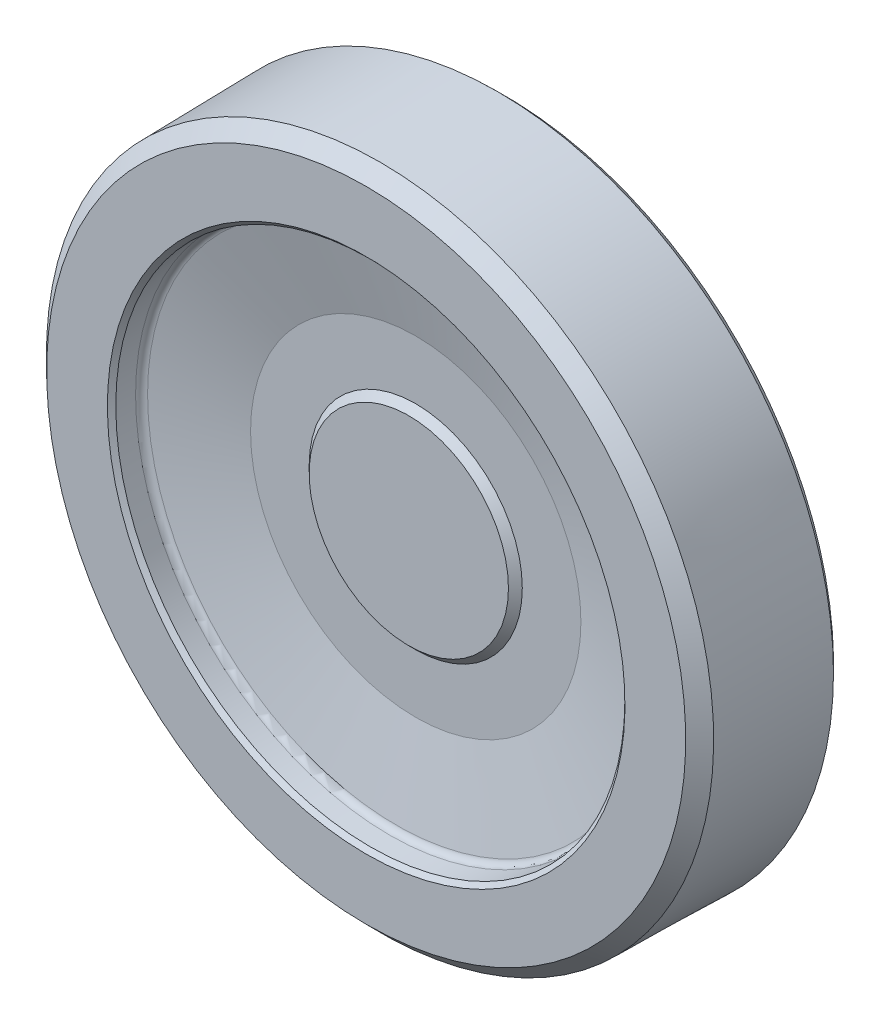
ISO-10303-21;
HEADER;
FILE_DESCRIPTION(('STEP AP214'),'2;1');
FILE_NAME('part.step','',(''),(''),'','','');
FILE_SCHEMA(('AUTOMOTIVE_DESIGN { 1 0 10303 214 1 1 1 1 }'));
ENDSEC;
DATA;
#1=APPLICATION_CONTEXT('core data for automotive mechanical design processes');
#2=APPLICATION_PROTOCOL_DEFINITION('international standard','automotive_design',2000,#1);
#3=PRODUCT_CONTEXT('',#1,'mechanical');
#4=PRODUCT('Part','Part','',(#3));
#5=PRODUCT_RELATED_PRODUCT_CATEGORY('part','',(#4));
#6=PRODUCT_DEFINITION_FORMATION('','',#4);
#7=PRODUCT_DEFINITION_CONTEXT('part definition',#1,'design');
#8=PRODUCT_DEFINITION('design','',#6,#7);
#9=PRODUCT_DEFINITION_SHAPE('','',#8);
#10=(LENGTH_UNIT() NAMED_UNIT(*) SI_UNIT(.MILLI.,.METRE.));
#11=(NAMED_UNIT(*) PLANE_ANGLE_UNIT() SI_UNIT($,.RADIAN.));
#12=(NAMED_UNIT(*) SI_UNIT($,.STERADIAN.) SOLID_ANGLE_UNIT());
#13=UNCERTAINTY_MEASURE_WITH_UNIT(LENGTH_MEASURE(1.E-05),#10,'distance_accuracy_value','');
#14=(GEOMETRIC_REPRESENTATION_CONTEXT(3) GLOBAL_UNCERTAINTY_ASSIGNED_CONTEXT((#13)) GLOBAL_UNIT_ASSIGNED_CONTEXT((#10,
#11,#12)) REPRESENTATION_CONTEXT('',''));
#15=CARTESIAN_POINT('',(0.,0.,0.));
#16=DIRECTION('',(0.,0.,1.));
#17=DIRECTION('',(1.,0.,0.));
#18=AXIS2_PLACEMENT_3D('',#15,#16,#17);
#19=CARTESIAN_POINT('',(9.5,0.,0.));
#20=DIRECTION('',(0.,0.,1.));
#21=DIRECTION('',(0.,-1.,0.));
#22=AXIS2_PLACEMENT_3D('',#19,#20,#21);
#23=PLANE('',#22);
#24=CARTESIAN_POINT('',(0.,0.,0.));
#25=DIRECTION('',(0.,0.,1.));
#26=DIRECTION('',(-1.,0.,0.));
#27=AXIS2_PLACEMENT_3D('',#24,#25,#26);
#28=CIRCLE('',#27,9.5);
#29=CARTESIAN_POINT('',(-9.5,0.,0.));
#30=VERTEX_POINT('',#29);
#31=EDGE_CURVE('E15',#30,#30,#28,.T.);
#32=ORIENTED_EDGE('',*,*,#31,.F.);
#33=EDGE_LOOP('',(#32));
#34=FACE_BOUND('',#33,.T.);
#35=ADVANCED_FACE('F12',(#34),#23,.F.);
#36=CARTESIAN_POINT('',(0.,0.,0.5));
#37=DIRECTION('',(0.,0.,1.));
#38=DIRECTION('',(-1.,0.,0.));
#39=AXIS2_PLACEMENT_3D('',#36,#37,#38);
#40=CONICAL_SURFACE('',#39,10.,0.785398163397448);
#41=CARTESIAN_POINT('',(0.,0.,0.5));
#42=DIRECTION('',(0.,0.,1.));
#43=DIRECTION('',(0.,-1.,0.));
#44=AXIS2_PLACEMENT_3D('',#41,#42,#43);
#45=CIRCLE('',#44,10.);
#46=CARTESIAN_POINT('',(0.,-10.,0.5));
#47=VERTEX_POINT('',#46);
#48=EDGE_CURVE('E186',#47,#47,#45,.T.);
#49=ORIENTED_EDGE('',*,*,#48,.F.);
#50=EDGE_LOOP('',(#49));
#51=FACE_BOUND('',#50,.T.);
#52=ORIENTED_EDGE('',*,*,#31,.T.);
#53=EDGE_LOOP('',(#52));
#54=FACE_BOUND('',#53,.T.);
#55=ADVANCED_FACE('F112',(#51,#54),#40,.T.);
#56=CARTESIAN_POINT('',(0.,0.,0.));
#57=DIRECTION('',(0.,0.,1.));
#58=DIRECTION('',(0.,-1.,0.));
#59=AXIS2_PLACEMENT_3D('',#56,#57,#58);
#60=CYLINDRICAL_SURFACE('',#59,10.);
#61=CARTESIAN_POINT('',(0.,0.,10.));
#62=DIRECTION('',(0.,0.,1.));
#63=DIRECTION('',(0.,-1.,0.));
#64=AXIS2_PLACEMENT_3D('',#61,#62,#63);
#65=CIRCLE('',#64,10.);
#66=CARTESIAN_POINT('',(0.,-10.,10.));
#67=VERTEX_POINT('',#66);
#68=EDGE_CURVE('E184',#67,#67,#65,.F.);
#69=ORIENTED_EDGE('',*,*,#68,.T.);
#70=EDGE_LOOP('',(#69));
#71=FACE_BOUND('',#70,.T.);
#72=ORIENTED_EDGE('',*,*,#48,.T.);
#73=EDGE_LOOP('',(#72));
#74=FACE_BOUND('',#73,.T.);
#75=ADVANCED_FACE('F109',(#71,#74),#60,.T.);
#76=CARTESIAN_POINT('',(0.,0.,24.));
#77=DIRECTION('',(0.,0.,-1.));
#78=DIRECTION('',(0.,1.,0.));
#79=AXIS2_PLACEMENT_3D('',#76,#77,#78);
#80=PLANE('',#79);
#81=CARTESIAN_POINT('',(0.,0.,24.));
#82=DIRECTION('',(0.,0.,-1.));
#83=DIRECTION('',(1.,0.,0.));
#84=AXIS2_PLACEMENT_3D('',#81,#82,#83);
#85=CIRCLE('',#84,9.35);
#86=CARTESIAN_POINT('',(9.35,0.,24.));
#87=VERTEX_POINT('',#86);
#88=EDGE_CURVE('E179',#87,#87,#85,.T.);
#89=ORIENTED_EDGE('',*,*,#88,.F.);
#90=EDGE_LOOP('',(#89));
#91=FACE_BOUND('',#90,.T.);
#92=ADVANCED_FACE('F105',(#91),#80,.F.);
#93=CARTESIAN_POINT('',(14.,0.,10.));
#94=DIRECTION('',(0.,0.,1.));
#95=DIRECTION('',(0.,-1.,0.));
#96=AXIS2_PLACEMENT_3D('',#93,#94,#95);
#97=PLANE('',#96);
#98=CARTESIAN_POINT('',(0.,0.,10.));
#99=DIRECTION('',(0.,0.,1.));
#100=DIRECTION('',(0.,-1.,0.));
#101=AXIS2_PLACEMENT_3D('',#98,#99,#100);
#102=CIRCLE('',#101,14.);
#103=CARTESIAN_POINT('',(0.,-14.,10.));
#104=VERTEX_POINT('',#103);
#105=EDGE_CURVE('E174',#104,#104,#102,.T.);
#106=ORIENTED_EDGE('',*,*,#105,.F.);
#107=EDGE_LOOP('',(#106));
#108=FACE_BOUND('',#107,.T.);
#109=ORIENTED_EDGE('',*,*,#68,.F.);
#110=EDGE_LOOP('',(#109));
#111=FACE_BOUND('',#110,.T.);
#112=ADVANCED_FACE('F101',(#108,#111),#97,.F.);
#113=CARTESIAN_POINT('',(0.,0.,23.35));
#114=DIRECTION('',(0.,0.,-1.));
#115=DIRECTION('',(1.,0.,0.));
#116=AXIS2_PLACEMENT_3D('',#113,#114,#115);
#117=CONICAL_SURFACE('',#116,10.,0.785398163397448);
#118=ORIENTED_EDGE('',*,*,#88,.T.);
#119=EDGE_LOOP('',(#118));
#120=FACE_BOUND('',#119,.T.);
#121=CARTESIAN_POINT('',(0.,0.,23.35));
#122=DIRECTION('',(0.,0.,-1.));
#123=DIRECTION('',(1.,0.,0.));
#124=AXIS2_PLACEMENT_3D('',#121,#122,#123);
#125=CIRCLE('',#124,10.);
#126=CARTESIAN_POINT('',(10.,0.,23.35));
#127=VERTEX_POINT('',#126);
#128=EDGE_CURVE('E170',#127,#127,#125,.F.);
#129=ORIENTED_EDGE('',*,*,#128,.T.);
#130=EDGE_LOOP('',(#129));
#131=FACE_BOUND('',#130,.T.);
#132=ADVANCED_FACE('F97',(#120,#131),#117,.T.);
#133=CARTESIAN_POINT('',(0.,0.,0.));
#134=DIRECTION('',(0.,0.,1.));
#135=DIRECTION('',(0.,-1.,0.));
#136=AXIS2_PLACEMENT_3D('',#133,#134,#135);
#137=CYLINDRICAL_SURFACE('',#136,14.);
#138=CARTESIAN_POINT('',(0.,0.,12.0560232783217));
#139=DIRECTION('',(0.,0.,-1.));
#140=DIRECTION('',(0.,1.,0.));
#141=AXIS2_PLACEMENT_3D('',#138,#139,#140);
#142=CIRCLE('',#141,14.);
#143=CARTESIAN_POINT('',(0.,14.,12.0560232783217));
#144=VERTEX_POINT('',#143);
#145=EDGE_CURVE('E82',#144,#144,#142,.T.);
#146=ORIENTED_EDGE('',*,*,#145,.T.);
#147=EDGE_LOOP('',(#146));
#148=FACE_BOUND('',#147,.T.);
#149=ORIENTED_EDGE('',*,*,#105,.T.);
#150=EDGE_LOOP('',(#149));
#151=FACE_BOUND('',#150,.T.);
#152=ADVANCED_FACE('F93',(#148,#151),#137,.T.);
#153=CARTESIAN_POINT('',(10.,0.,23.35));
#154=DIRECTION('',(0.,0.,-1.));
#155=DIRECTION('',(0.,1.,0.));
#156=AXIS2_PLACEMENT_3D('',#153,#154,#155);
#157=PLANE('',#156);
#158=ORIENTED_EDGE('',*,*,#128,.F.);
#159=EDGE_LOOP('',(#158));
#160=FACE_BOUND('',#159,.T.);
#161=CARTESIAN_POINT('',(0.,0.,23.35));
#162=DIRECTION('',(0.,0.,1.));
#163=DIRECTION('',(-1.,0.,0.));
#164=AXIS2_PLACEMENT_3D('',#161,#162,#163);
#165=CIRCLE('',#164,15.5);
#166=CARTESIAN_POINT('',(-15.5,0.,23.35));
#167=VERTEX_POINT('',#166);
#168=EDGE_CURVE('E77',#167,#167,#165,.T.);
#169=ORIENTED_EDGE('',*,*,#168,.T.);
#170=EDGE_LOOP('',(#169));
#171=FACE_BOUND('',#170,.T.);
#172=ADVANCED_FACE('F89',(#160,#171),#157,.F.);
#173=CARTESIAN_POINT('',(0.,0.,12.0560232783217));
#174=DIRECTION('',(0.,0.,-1.));
#175=DIRECTION('',(0.,1.,0.));
#176=AXIS2_PLACEMENT_3D('',#173,#174,#175);
#177=TOROIDAL_SURFACE('',#176,15.3,1.3);
#178=CARTESIAN_POINT('',(0.,0.,13.2776236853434));
#179=DIRECTION('',(0.,0.,1.));
#180=DIRECTION('',(0.,-1.,0.));
#181=AXIS2_PLACEMENT_3D('',#178,#179,#180);
#182=CIRCLE('',#181,14.8553738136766);
#183=CARTESIAN_POINT('',(0.,-14.8553738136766,13.2776236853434));
#184=VERTEX_POINT('',#183);
#185=EDGE_CURVE('E72',#184,#184,#182,.T.);
#186=ORIENTED_EDGE('',*,*,#185,.F.);
#187=EDGE_LOOP('',(#186));
#188=FACE_BOUND('',#187,.T.);
#189=ORIENTED_EDGE('',*,*,#145,.F.);
#190=EDGE_LOOP('',(#189));
#191=FACE_BOUND('',#190,.T.);
#192=ADVANCED_FACE('F85',(#188,#191),#177,.F.);
#193=CARTESIAN_POINT('',(0.,0.,25.1626232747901));
#194=DIRECTION('',(0.,0.,1.));
#195=DIRECTION('',(-1.,0.,0.));
#196=AXIS2_PLACEMENT_3D('',#193,#194,#195);
#197=CONICAL_SURFACE('',#196,23.351333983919,1.34390352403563);
#198=ORIENTED_EDGE('',*,*,#168,.F.);
#199=EDGE_LOOP('',(#198));
#200=FACE_BOUND('',#199,.T.);
#201=CARTESIAN_POINT('',(0.,0.,25.1626232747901));
#202=DIRECTION('',(0.,0.,-1.));
#203=DIRECTION('',(0.,1.,0.));
#204=AXIS2_PLACEMENT_3D('',#201,#202,#203);
#205=CIRCLE('',#204,23.351333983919);
#206=CARTESIAN_POINT('',(0.,23.351333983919,25.1626232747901));
#207=VERTEX_POINT('',#206);
#208=EDGE_CURVE('E69',#207,#207,#205,.F.);
#209=ORIENTED_EDGE('',*,*,#208,.T.);
#210=EDGE_LOOP('',(#209));
#211=FACE_BOUND('',#210,.T.);
#212=ADVANCED_FACE('F88',(#200,#211),#197,.F.);
#213=CARTESIAN_POINT('',(0.,0.,16.2325039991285));
#214=DIRECTION('',(0.,0.,1.));
#215=DIRECTION('',(0.,-1.,0.));
#216=AXIS2_PLACEMENT_3D('',#213,#214,#215);
#217=CONICAL_SURFACE('',#216,22.9738407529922,1.22173047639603);
#218=CARTESIAN_POINT('',(0.,0.,16.2325039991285));
#219=DIRECTION('',(0.,0.,-1.));
#220=DIRECTION('',(0.,1.,0.));
#221=AXIS2_PLACEMENT_3D('',#218,#219,#220);
#222=CIRCLE('',#221,22.9738407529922);
#223=CARTESIAN_POINT('',(0.,22.9738407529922,16.2325039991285));
#224=VERTEX_POINT('',#223);
#225=EDGE_CURVE('E45',#224,#224,#222,.T.);
#226=ORIENTED_EDGE('',*,*,#225,.T.);
#227=EDGE_LOOP('',(#226));
#228=FACE_BOUND('',#227,.T.);
#229=ORIENTED_EDGE('',*,*,#185,.T.);
#230=EDGE_LOOP('',(#229));
#231=FACE_BOUND('',#230,.T.);
#232=ADVANCED_FACE('F63',(#228,#231),#217,.T.);
#233=CARTESIAN_POINT('',(0.,0.,25.7959638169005));
#234=DIRECTION('',(0.,0.,-1.));
#235=DIRECTION('',(0.,1.,0.));
#236=AXIS2_PLACEMENT_3D('',#233,#234,#235);
#237=TOROIDAL_SURFACE('',#236,23.2051157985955,0.65);
#238=ORIENTED_EDGE('',*,*,#208,.F.);
#239=EDGE_LOOP('',(#238));
#240=FACE_BOUND('',#239,.T.);
#241=CARTESIAN_POINT('',(0.,0.,25.7846197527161));
#242=DIRECTION('',(0.,0.,1.));
#243=DIRECTION('',(0.,-1.,0.));
#244=AXIS2_PLACEMENT_3D('',#241,#242,#243);
#245=CIRCLE('',#244,23.8550168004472);
#246=CARTESIAN_POINT('',(0.,-23.8550168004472,25.7846197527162));
#247=VERTEX_POINT('',#246);
#248=EDGE_CURVE('E40',#247,#247,#245,.T.);
#249=ORIENTED_EDGE('',*,*,#248,.T.);
#250=EDGE_LOOP('',(#249));
#251=FACE_BOUND('',#250,.T.);
#252=ADVANCED_FACE('F57',(#240,#251),#237,.F.);
#253=CARTESIAN_POINT('',(0.,0.,15.6217037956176));
#254=DIRECTION('',(0.,0.,-1.));
#255=DIRECTION('',(0.,1.,0.));
#256=AXIS2_PLACEMENT_3D('',#253,#254,#255);
#257=TOROIDAL_SURFACE('',#256,23.1961538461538,0.65);
#258=CARTESIAN_POINT('',(0.,0.,15.6217037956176));
#259=DIRECTION('',(0.,0.,1.));
#260=DIRECTION('',(0.,-1.,0.));
#261=AXIS2_PLACEMENT_3D('',#258,#259,#260);
#262=CIRCLE('',#261,23.8461538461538);
#263=CARTESIAN_POINT('',(0.,-23.8461538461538,15.6217037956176));
#264=VERTEX_POINT('',#263);
#265=EDGE_CURVE('E35',#264,#264,#262,.F.);
#266=ORIENTED_EDGE('',*,*,#265,.T.);
#267=EDGE_LOOP('',(#266));
#268=FACE_BOUND('',#267,.T.);
#269=ORIENTED_EDGE('',*,*,#225,.F.);
#270=EDGE_LOOP('',(#269));
#271=FACE_BOUND('',#270,.T.);
#272=ADVANCED_FACE('F52',(#268,#271),#257,.F.);
#273=CARTESIAN_POINT('',(0.,0.,27.6100593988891));
#274=DIRECTION('',(0.,0.,1.));
#275=DIRECTION('',(0.,-1.,0.));
#276=AXIS2_PLACEMENT_3D('',#273,#274,#275);
#277=CONICAL_SURFACE('',#276,23.8868799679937,0.0174532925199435);
#278=ORIENTED_EDGE('',*,*,#248,.F.);
#279=EDGE_LOOP('',(#278));
#280=FACE_BOUND('',#279,.T.);
#281=CARTESIAN_POINT('',(0.,0.,27.610059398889));
#282=DIRECTION('',(0.,0.,1.));
#283=DIRECTION('',(0.,-1.,0.));
#284=AXIS2_PLACEMENT_3D('',#281,#282,#283);
#285=CIRCLE('',#284,23.8868799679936);
#286=CARTESIAN_POINT('',(0.,-23.8868799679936,27.610059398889));
#287=VERTEX_POINT('',#286);
#288=EDGE_CURVE('E31',#287,#287,#285,.T.);
#289=ORIENTED_EDGE('',*,*,#288,.T.);
#290=EDGE_LOOP('',(#289));
#291=FACE_BOUND('',#290,.T.);
#292=ADVANCED_FACE('F56',(#280,#291),#277,.F.);
#293=CARTESIAN_POINT('',(0.,0.,0.));
#294=DIRECTION('',(0.,0.,1.));
#295=DIRECTION('',(0.,-1.,0.));
#296=AXIS2_PLACEMENT_3D('',#293,#294,#295);
#297=CYLINDRICAL_SURFACE('',#296,23.8461538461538);
#298=CARTESIAN_POINT('',(0.,0.,15.));
#299=DIRECTION('',(0.,0.,1.));
#300=DIRECTION('',(0.,-1.,0.));
#301=AXIS2_PLACEMENT_3D('',#298,#299,#300);
#302=CIRCLE('',#301,23.8461538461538);
#303=CARTESIAN_POINT('',(0.,-23.8461538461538,15.));
#304=VERTEX_POINT('',#303);
#305=EDGE_CURVE('E34',#304,#304,#302,.F.);
#306=ORIENTED_EDGE('',*,*,#305,.T.);
#307=EDGE_LOOP('',(#306));
#308=FACE_BOUND('',#307,.T.);
#309=ORIENTED_EDGE('',*,*,#265,.F.);
#310=EDGE_LOOP('',(#309));
#311=FACE_BOUND('',#310,.T.);
#312=ADVANCED_FACE('F148',(#308,#311),#297,.F.);
#313=CARTESIAN_POINT('',(0.,0.,28.));
#314=DIRECTION('',(0.,0.,1.));
#315=DIRECTION('',(0.,-1.,0.));
#316=AXIS2_PLACEMENT_3D('',#313,#314,#315);
#317=CONICAL_SURFACE('',#316,24.2836864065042,0.794124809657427);
#318=ORIENTED_EDGE('',*,*,#288,.F.);
#319=EDGE_LOOP('',(#318));
#320=FACE_BOUND('',#319,.T.);
#321=CARTESIAN_POINT('',(0.,0.,28.));
#322=DIRECTION('',(0.,0.,1.));
#323=DIRECTION('',(0.,-1.,0.));
#324=AXIS2_PLACEMENT_3D('',#321,#322,#323);
#325=CIRCLE('',#324,24.2836864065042);
#326=CARTESIAN_POINT('',(0.,-24.2836864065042,28.));
#327=VERTEX_POINT('',#326);
#328=EDGE_CURVE('E201',#327,#327,#325,.T.);
#329=ORIENTED_EDGE('',*,*,#328,.T.);
#330=EDGE_LOOP('',(#329));
#331=FACE_BOUND('',#330,.T.);
#332=ADVANCED_FACE('F145',(#320,#331),#317,.F.);
#333=CARTESIAN_POINT('',(30.8613457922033,0.,15.));
#334=DIRECTION('',(0.,0.,1.));
#335=DIRECTION('',(0.,-1.,0.));
#336=AXIS2_PLACEMENT_3D('',#333,#334,#335);
#337=PLANE('',#336);
#338=CARTESIAN_POINT('',(0.,0.,15.));
#339=DIRECTION('',(0.,0.,1.));
#340=DIRECTION('',(0.,-1.,0.));
#341=AXIS2_PLACEMENT_3D('',#338,#339,#340);
#342=CIRCLE('',#341,30.8613457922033);
#343=CARTESIAN_POINT('',(0.,-30.8613457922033,15.));
#344=VERTEX_POINT('',#343);
#345=EDGE_CURVE('E198',#344,#344,#342,.T.);
#346=ORIENTED_EDGE('',*,*,#345,.F.);
#347=EDGE_LOOP('',(#346));
#348=FACE_BOUND('',#347,.T.);
#349=ORIENTED_EDGE('',*,*,#305,.F.);
#350=EDGE_LOOP('',(#349));
#351=FACE_BOUND('',#350,.T.);
#352=ADVANCED_FACE('F141',(#348,#351),#337,.F.);
#353=CARTESIAN_POINT('',(24.2836864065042,0.,28.));
#354=DIRECTION('',(0.,0.,-1.));
#355=DIRECTION('',(0.,1.,0.));
#356=AXIS2_PLACEMENT_3D('',#353,#354,#355);
#357=PLANE('',#356);
#358=ORIENTED_EDGE('',*,*,#328,.F.);
#359=EDGE_LOOP('',(#358));
#360=FACE_BOUND('',#359,.T.);
#361=CARTESIAN_POINT('',(0.,0.,28.));
#362=DIRECTION('',(0.,0.,-1.));
#363=DIRECTION('',(0.,1.,0.));
#364=AXIS2_PLACEMENT_3D('',#361,#362,#363);
#365=CIRCLE('',#364,29.9844299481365);
#366=CARTESIAN_POINT('',(0.,29.9844299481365,28.));
#367=VERTEX_POINT('',#366);
#368=EDGE_CURVE('E24',#367,#367,#365,.T.);
#369=ORIENTED_EDGE('',*,*,#368,.F.);
#370=EDGE_LOOP('',(#369));
#371=FACE_BOUND('',#370,.T.);
#372=ADVANCED_FACE('F137',(#360,#371),#357,.F.);
#373=CARTESIAN_POINT('',(0.,0.,15.6499010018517));
#374=DIRECTION('',(0.,0.,1.));
#375=DIRECTION('',(0.,-1.,0.));
#376=AXIS2_PLACEMENT_3D('',#373,#374,#375);
#377=CONICAL_SURFACE('',#376,31.5000017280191,0.776671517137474);
#378=CARTESIAN_POINT('',(0.,0.,15.6499010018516));
#379=DIRECTION('',(0.,0.,-1.));
#380=DIRECTION('',(0.,1.,0.));
#381=AXIS2_PLACEMENT_3D('',#378,#379,#380);
#382=CIRCLE('',#381,31.5000017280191);
#383=CARTESIAN_POINT('',(0.,31.5000017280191,15.6499010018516));
#384=VERTEX_POINT('',#383);
#385=EDGE_CURVE('E19',#384,#384,#382,.F.);
#386=ORIENTED_EDGE('',*,*,#385,.F.);
#387=EDGE_LOOP('',(#386));
#388=FACE_BOUND('',#387,.T.);
#389=ORIENTED_EDGE('',*,*,#345,.T.);
#390=EDGE_LOOP('',(#389));
#391=FACE_BOUND('',#390,.T.);
#392=ADVANCED_FACE('F130',(#388,#391),#377,.T.);
#393=CARTESIAN_POINT('',(0.,0.,26.7001979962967));
#394=DIRECTION('',(0.,0.,-1.));
#395=DIRECTION('',(0.,1.,0.));
#396=AXIS2_PLACEMENT_3D('',#393,#394,#395);
#397=CONICAL_SURFACE('',#396,31.307118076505,0.79412480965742);
#398=ORIENTED_EDGE('',*,*,#368,.T.);
#399=EDGE_LOOP('',(#398));
#400=FACE_BOUND('',#399,.T.);
#401=CARTESIAN_POINT('',(0.,0.,26.7001979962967));
#402=DIRECTION('',(0.,0.,-1.));
#403=DIRECTION('',(0.,1.,0.));
#404=AXIS2_PLACEMENT_3D('',#401,#402,#403);
#405=CIRCLE('',#404,31.307118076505);
#406=CARTESIAN_POINT('',(0.,31.307118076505,26.7001979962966));
#407=VERTEX_POINT('',#406);
#408=EDGE_CURVE('E8',#407,#407,#405,.T.);
#409=ORIENTED_EDGE('',*,*,#408,.F.);
#410=EDGE_LOOP('',(#409));
#411=FACE_BOUND('',#410,.T.);
#412=ADVANCED_FACE('F125',(#400,#411),#397,.T.);
#413=CARTESIAN_POINT('',(0.,0.,15.6499010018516));
#414=DIRECTION('',(0.,0.,-1.));
#415=DIRECTION('',(0.,1.,0.));
#416=AXIS2_PLACEMENT_3D('',#413,#414,#415);
#417=CONICAL_SURFACE('',#416,31.5000017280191,0.0174532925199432);
#418=ORIENTED_EDGE('',*,*,#408,.T.);
#419=EDGE_LOOP('',(#418));
#420=FACE_BOUND('',#419,.T.);
#421=ORIENTED_EDGE('',*,*,#385,.T.);
#422=EDGE_LOOP('',(#421));
#423=FACE_BOUND('',#422,.T.);
#424=ADVANCED_FACE('F123',(#420,#423),#417,.T.);
#425=CLOSED_SHELL('',(#35,#55,#75,#92,#112,#132,#152,#172,#192,#212,#232,#252,#272,#292,#312,
#332,#352,#372,#392,#412,#424));
#426=MANIFOLD_SOLID_BREP('B1',#425);
#427=ADVANCED_BREP_SHAPE_REPRESENTATION('',(#18,#426),#14);
#428=SHAPE_DEFINITION_REPRESENTATION(#9,#427);
ENDSEC;
END-ISO-10303-21;
